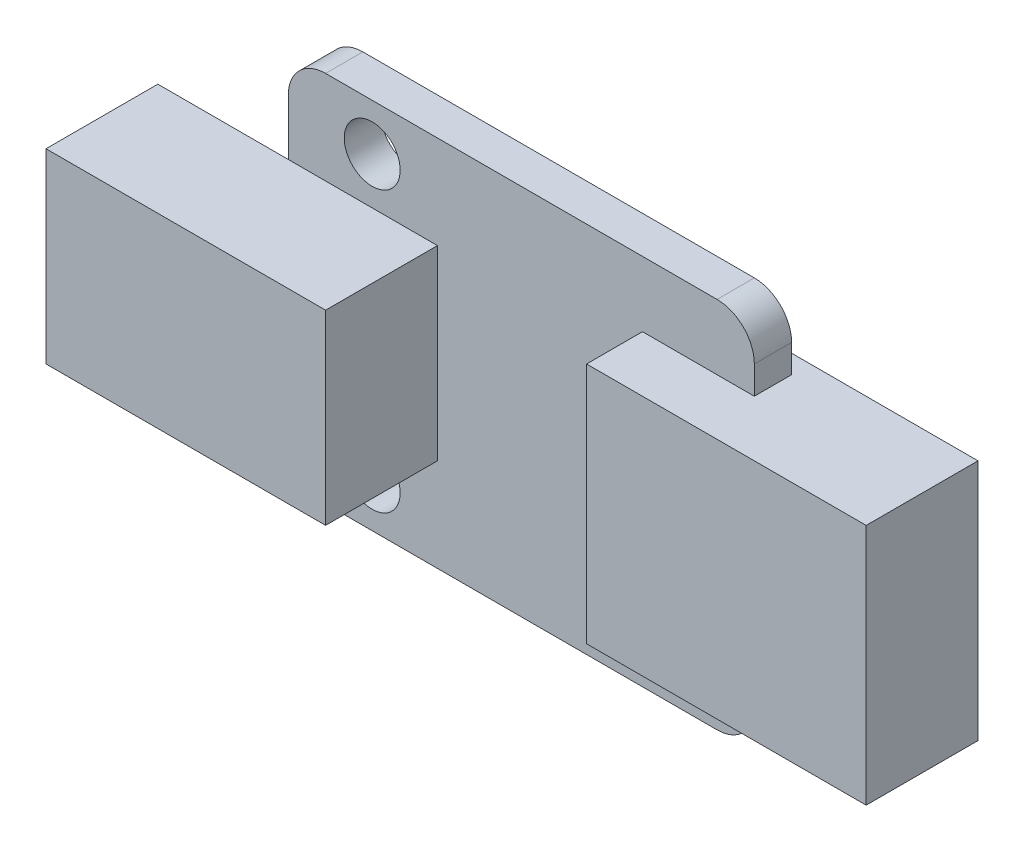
ISO-10303-21;
HEADER;
FILE_DESCRIPTION(('STEP AP214'),'2;1');
FILE_NAME('part.step','',(''),(''),'','','');
FILE_SCHEMA(('AUTOMOTIVE_DESIGN { 1 0 10303 214 1 1 1 1 }'));
ENDSEC;
DATA;
#1=APPLICATION_CONTEXT('core data for automotive mechanical design processes');
#2=APPLICATION_PROTOCOL_DEFINITION('international standard','automotive_design',2000,#1);
#3=PRODUCT_CONTEXT('',#1,'mechanical');
#4=PRODUCT('Part','Part','',(#3));
#5=PRODUCT_RELATED_PRODUCT_CATEGORY('part','',(#4));
#6=PRODUCT_DEFINITION_FORMATION('','',#4);
#7=PRODUCT_DEFINITION_CONTEXT('part definition',#1,'design');
#8=PRODUCT_DEFINITION('design','',#6,#7);
#9=PRODUCT_DEFINITION_SHAPE('','',#8);
#10=(LENGTH_UNIT() NAMED_UNIT(*) SI_UNIT(.MILLI.,.METRE.));
#11=(NAMED_UNIT(*) PLANE_ANGLE_UNIT() SI_UNIT($,.RADIAN.));
#12=(NAMED_UNIT(*) SI_UNIT($,.STERADIAN.) SOLID_ANGLE_UNIT());
#13=UNCERTAINTY_MEASURE_WITH_UNIT(LENGTH_MEASURE(1.E-05),#10,'distance_accuracy_value','');
#14=(GEOMETRIC_REPRESENTATION_CONTEXT(3) GLOBAL_UNCERTAINTY_ASSIGNED_CONTEXT((#13)) GLOBAL_UNIT_ASSIGNED_CONTEXT((#10,
#11,#12)) REPRESENTATION_CONTEXT('',''));
#15=CARTESIAN_POINT('',(0.,0.,0.));
#16=DIRECTION('',(0.,0.,1.));
#17=DIRECTION('',(1.,0.,0.));
#18=AXIS2_PLACEMENT_3D('',#15,#16,#17);
#19=CARTESIAN_POINT('',(0.,0.,2.));
#20=DIRECTION('',(0.,0.,1.));
#21=DIRECTION('',(1.,0.,0.));
#22=AXIS2_PLACEMENT_3D('',#19,#20,#21);
#23=PLANE('',#22);
#24=CARTESIAN_POINT('',(-8.,7.5,2.));
#25=DIRECTION('',(0.,0.,1.));
#26=DIRECTION('',(1.,0.,0.));
#27=AXIS2_PLACEMENT_3D('',#24,#25,#26);
#28=CIRCLE('',#27,1.5);
#29=CARTESIAN_POINT('',(-6.5,7.5,2.));
#30=VERTEX_POINT('',#29);
#31=EDGE_CURVE('E266',#30,#30,#28,.T.);
#32=ORIENTED_EDGE('',*,*,#31,.F.);
#33=EDGE_LOOP('',(#32));
#34=FACE_BOUND('',#33,.T.);
#35=CARTESIAN_POINT('',(-8.,-7.5,2.));
#36=DIRECTION('',(0.,0.,1.));
#37=DIRECTION('',(1.,0.,0.));
#38=AXIS2_PLACEMENT_3D('',#35,#36,#37);
#39=CIRCLE('',#38,1.5);
#40=CARTESIAN_POINT('',(-6.5,-7.5,2.));
#41=VERTEX_POINT('',#40);
#42=EDGE_CURVE('E260',#41,#41,#39,.T.);
#43=ORIENTED_EDGE('',*,*,#42,.F.);
#44=EDGE_LOOP('',(#43));
#45=FACE_BOUND('',#44,.T.);
#46=DIRECTION('',(-1.,0.,0.));
#47=VECTOR('',#46,1.);
#48=CARTESIAN_POINT('',(-12.5,10.,2.));
#49=LINE('',#48,#47);
#50=CARTESIAN_POINT('',(10.5,10.,2.));
#51=VERTEX_POINT('',#50);
#52=CARTESIAN_POINT('',(-10.5,10.,2.));
#53=VERTEX_POINT('',#52);
#54=EDGE_CURVE('E274',#51,#53,#49,.T.);
#55=ORIENTED_EDGE('',*,*,#54,.T.);
#56=CARTESIAN_POINT('',(-10.5,8.,2.));
#57=DIRECTION('',(0.,0.,1.));
#58=DIRECTION('',(1.,0.,0.));
#59=AXIS2_PLACEMENT_3D('',#56,#57,#58);
#60=CIRCLE('',#59,2.);
#61=CARTESIAN_POINT('',(-12.5,8.,2.));
#62=VERTEX_POINT('',#61);
#63=EDGE_CURVE('E327',#53,#62,#60,.T.);
#64=ORIENTED_EDGE('',*,*,#63,.T.);
#65=DIRECTION('',(0.,-1.,0.));
#66=VECTOR('',#65,1.);
#67=CARTESIAN_POINT('',(-12.5,10.,2.));
#68=LINE('',#67,#66);
#69=CARTESIAN_POINT('',(-12.5,5.,2.));
#70=VERTEX_POINT('',#69);
#71=EDGE_CURVE('E279',#62,#70,#68,.T.);
#72=ORIENTED_EDGE('',*,*,#71,.T.);
#73=DIRECTION('',(-1.,0.,0.));
#74=VECTOR('',#73,1.);
#75=CARTESIAN_POINT('',(-4.5,5.,2.));
#76=LINE('',#75,#74);
#77=CARTESIAN_POINT('',(-4.5,5.,2.));
#78=VERTEX_POINT('',#77);
#79=EDGE_CURVE('E203',#78,#70,#76,.T.);
#80=ORIENTED_EDGE('',*,*,#79,.F.);
#81=DIRECTION('',(0.,1.,0.));
#82=VECTOR('',#81,1.);
#83=CARTESIAN_POINT('',(-4.5,5.,2.));
#84=LINE('',#83,#82);
#85=CARTESIAN_POINT('',(-4.5,-5.,2.));
#86=VERTEX_POINT('',#85);
#87=EDGE_CURVE('E443',#86,#78,#84,.T.);
#88=ORIENTED_EDGE('',*,*,#87,.F.);
#89=DIRECTION('',(1.,0.,0.));
#90=VECTOR('',#89,1.);
#91=CARTESIAN_POINT('',(-4.5,-5.,2.));
#92=LINE('',#91,#90);
#93=CARTESIAN_POINT('',(-12.5,-5.,2.));
#94=VERTEX_POINT('',#93);
#95=EDGE_CURVE('E435',#94,#86,#92,.T.);
#96=ORIENTED_EDGE('',*,*,#95,.F.);
#97=CARTESIAN_POINT('',(-12.5,-8.,2.));
#98=VERTEX_POINT('',#97);
#99=EDGE_CURVE('E278',#94,#98,#68,.T.);
#100=ORIENTED_EDGE('',*,*,#99,.T.);
#101=CARTESIAN_POINT('',(-10.5,-8.,2.));
#102=DIRECTION('',(0.,0.,1.));
#103=DIRECTION('',(1.,0.,0.));
#104=AXIS2_PLACEMENT_3D('',#101,#102,#103);
#105=CIRCLE('',#104,2.);
#106=CARTESIAN_POINT('',(-10.5,-10.,2.));
#107=VERTEX_POINT('',#106);
#108=EDGE_CURVE('E323',#98,#107,#105,.T.);
#109=ORIENTED_EDGE('',*,*,#108,.T.);
#110=DIRECTION('',(1.,0.,0.));
#111=VECTOR('',#110,1.);
#112=CARTESIAN_POINT('',(-12.5,-10.,2.));
#113=LINE('',#112,#111);
#114=CARTESIAN_POINT('',(10.5,-10.,2.));
#115=VERTEX_POINT('',#114);
#116=EDGE_CURVE('E281',#107,#115,#113,.T.);
#117=ORIENTED_EDGE('',*,*,#116,.T.);
#118=CARTESIAN_POINT('',(10.5,-8.,2.));
#119=DIRECTION('',(0.,0.,1.));
#120=DIRECTION('',(1.,0.,0.));
#121=AXIS2_PLACEMENT_3D('',#118,#119,#120);
#122=CIRCLE('',#121,2.);
#123=CARTESIAN_POINT('',(12.5,-8.,2.));
#124=VERTEX_POINT('',#123);
#125=EDGE_CURVE('E58',#115,#124,#122,.T.);
#126=ORIENTED_EDGE('',*,*,#125,.T.);
#127=DIRECTION('',(0.,1.,0.));
#128=VECTOR('',#127,1.);
#129=CARTESIAN_POINT('',(12.5,10.,2.));
#130=LINE('',#129,#128);
#131=CARTESIAN_POINT('',(12.5,-6.5,2.));
#132=VERTEX_POINT('',#131);
#133=EDGE_CURVE('E272',#124,#132,#130,.T.);
#134=ORIENTED_EDGE('',*,*,#133,.T.);
#135=DIRECTION('',(-1.,0.,0.));
#136=VECTOR('',#135,1.);
#137=CARTESIAN_POINT('',(0.,-6.5,2.));
#138=LINE('',#137,#136);
#139=CARTESIAN_POINT('',(6.5,-6.5,2.));
#140=VERTEX_POINT('',#139);
#141=EDGE_CURVE('E250',#132,#140,#138,.T.);
#142=ORIENTED_EDGE('',*,*,#141,.T.);
#143=DIRECTION('',(0.,1.,0.));
#144=VECTOR('',#143,1.);
#145=CARTESIAN_POINT('',(6.5,0.,2.));
#146=LINE('',#145,#144);
#147=CARTESIAN_POINT('',(6.5,6.5,2.));
#148=VERTEX_POINT('',#147);
#149=EDGE_CURVE('E257',#140,#148,#146,.T.);
#150=ORIENTED_EDGE('',*,*,#149,.T.);
#151=DIRECTION('',(1.,0.,0.));
#152=VECTOR('',#151,1.);
#153=CARTESIAN_POINT('',(0.,6.5,2.));
#154=LINE('',#153,#152);
#155=CARTESIAN_POINT('',(12.5,6.5,2.));
#156=VERTEX_POINT('',#155);
#157=EDGE_CURVE('E255',#148,#156,#154,.T.);
#158=ORIENTED_EDGE('',*,*,#157,.T.);
#159=CARTESIAN_POINT('',(12.5,8.,2.));
#160=VERTEX_POINT('',#159);
#161=EDGE_CURVE('E275',#156,#160,#130,.T.);
#162=ORIENTED_EDGE('',*,*,#161,.T.);
#163=CARTESIAN_POINT('',(10.5,8.,2.));
#164=DIRECTION('',(0.,0.,1.));
#165=DIRECTION('',(1.,0.,0.));
#166=AXIS2_PLACEMENT_3D('',#163,#164,#165);
#167=CIRCLE('',#166,2.);
#168=EDGE_CURVE('E325',#160,#51,#167,.T.);
#169=ORIENTED_EDGE('',*,*,#168,.T.);
#170=EDGE_LOOP('',(#55,#64,#72,#80,#88,#96,#100,#109,#117,#126,#134,#142,#150,#158,#162,#169));
#171=FACE_BOUND('',#170,.T.);
#172=ADVANCED_FACE('F35',(#34,#45,#171),#23,.T.);
#173=CARTESIAN_POINT('',(0.,0.,0.));
#174=DIRECTION('',(0.,0.,1.));
#175=DIRECTION('',(1.,0.,0.));
#176=AXIS2_PLACEMENT_3D('',#173,#174,#175);
#177=PLANE('',#176);
#178=CARTESIAN_POINT('',(-8.,-7.5,0.));
#179=DIRECTION('',(0.,0.,1.));
#180=DIRECTION('',(1.,0.,0.));
#181=AXIS2_PLACEMENT_3D('',#178,#179,#180);
#182=CIRCLE('',#181,1.5);
#183=CARTESIAN_POINT('',(-6.5,-7.5,0.));
#184=VERTEX_POINT('',#183);
#185=EDGE_CURVE('E259',#184,#184,#182,.T.);
#186=ORIENTED_EDGE('',*,*,#185,.T.);
#187=EDGE_LOOP('',(#186));
#188=FACE_BOUND('',#187,.T.);
#189=CARTESIAN_POINT('',(-8.,7.5,0.));
#190=DIRECTION('',(0.,0.,1.));
#191=DIRECTION('',(1.,0.,0.));
#192=AXIS2_PLACEMENT_3D('',#189,#190,#191);
#193=CIRCLE('',#192,1.5);
#194=CARTESIAN_POINT('',(-6.5,7.5,0.));
#195=VERTEX_POINT('',#194);
#196=EDGE_CURVE('E263',#195,#195,#193,.T.);
#197=ORIENTED_EDGE('',*,*,#196,.T.);
#198=EDGE_LOOP('',(#197));
#199=FACE_BOUND('',#198,.T.);
#200=DIRECTION('',(0.,-1.,0.));
#201=VECTOR('',#200,1.);
#202=CARTESIAN_POINT('',(-12.5,10.,0.));
#203=LINE('',#202,#201);
#204=CARTESIAN_POINT('',(-12.5,8.,0.));
#205=VERTEX_POINT('',#204);
#206=CARTESIAN_POINT('',(-12.5,-8.,0.));
#207=VERTEX_POINT('',#206);
#208=EDGE_CURVE('E290',#205,#207,#203,.T.);
#209=ORIENTED_EDGE('',*,*,#208,.F.);
#210=CARTESIAN_POINT('',(-10.5,8.,0.));
#211=DIRECTION('',(0.,0.,1.));
#212=DIRECTION('',(1.,0.,0.));
#213=AXIS2_PLACEMENT_3D('',#210,#211,#212);
#214=CIRCLE('',#213,2.);
#215=CARTESIAN_POINT('',(-10.5,10.,0.));
#216=VERTEX_POINT('',#215);
#217=EDGE_CURVE('E315',#205,#216,#214,.F.);
#218=ORIENTED_EDGE('',*,*,#217,.T.);
#219=DIRECTION('',(-1.,0.,0.));
#220=VECTOR('',#219,1.);
#221=CARTESIAN_POINT('',(-12.5,10.,0.));
#222=LINE('',#221,#220);
#223=CARTESIAN_POINT('',(10.5,10.,0.));
#224=VERTEX_POINT('',#223);
#225=EDGE_CURVE('E287',#224,#216,#222,.T.);
#226=ORIENTED_EDGE('',*,*,#225,.F.);
#227=CARTESIAN_POINT('',(10.5,8.,0.));
#228=DIRECTION('',(0.,0.,1.));
#229=DIRECTION('',(1.,0.,0.));
#230=AXIS2_PLACEMENT_3D('',#227,#228,#229);
#231=CIRCLE('',#230,2.);
#232=CARTESIAN_POINT('',(12.5,8.,0.));
#233=VERTEX_POINT('',#232);
#234=EDGE_CURVE('E313',#224,#233,#231,.F.);
#235=ORIENTED_EDGE('',*,*,#234,.T.);
#236=DIRECTION('',(0.,1.,0.));
#237=VECTOR('',#236,1.);
#238=CARTESIAN_POINT('',(12.5,10.,0.));
#239=LINE('',#238,#237);
#240=CARTESIAN_POINT('',(12.5,6.5,0.));
#241=VERTEX_POINT('',#240);
#242=EDGE_CURVE('E269',#241,#233,#239,.T.);
#243=ORIENTED_EDGE('',*,*,#242,.F.);
#244=DIRECTION('',(1.,0.,0.));
#245=VECTOR('',#244,1.);
#246=CARTESIAN_POINT('',(0.,6.5,0.));
#247=LINE('',#246,#245);
#248=CARTESIAN_POINT('',(6.5,6.5,0.));
#249=VERTEX_POINT('',#248);
#250=EDGE_CURVE('E252',#249,#241,#247,.T.);
#251=ORIENTED_EDGE('',*,*,#250,.F.);
#252=DIRECTION('',(0.,1.,0.));
#253=VECTOR('',#252,1.);
#254=CARTESIAN_POINT('',(6.5,0.,0.));
#255=LINE('',#254,#253);
#256=CARTESIAN_POINT('',(6.5,-6.5,0.));
#257=VERTEX_POINT('',#256);
#258=EDGE_CURVE('E301',#257,#249,#255,.T.);
#259=ORIENTED_EDGE('',*,*,#258,.F.);
#260=DIRECTION('',(-1.,0.,0.));
#261=VECTOR('',#260,1.);
#262=CARTESIAN_POINT('',(0.,-6.5,0.));
#263=LINE('',#262,#261);
#264=CARTESIAN_POINT('',(12.5,-6.5,0.));
#265=VERTEX_POINT('',#264);
#266=EDGE_CURVE('E247',#265,#257,#263,.T.);
#267=ORIENTED_EDGE('',*,*,#266,.F.);
#268=CARTESIAN_POINT('',(12.5,-8.,0.));
#269=VERTEX_POINT('',#268);
#270=EDGE_CURVE('E285',#269,#265,#239,.T.);
#271=ORIENTED_EDGE('',*,*,#270,.F.);
#272=CARTESIAN_POINT('',(10.5,-8.,0.));
#273=DIRECTION('',(0.,0.,1.));
#274=DIRECTION('',(1.,0.,0.));
#275=AXIS2_PLACEMENT_3D('',#272,#273,#274);
#276=CIRCLE('',#275,2.);
#277=CARTESIAN_POINT('',(10.5,-10.,0.));
#278=VERTEX_POINT('',#277);
#279=EDGE_CURVE('E309',#269,#278,#276,.F.);
#280=ORIENTED_EDGE('',*,*,#279,.T.);
#281=DIRECTION('',(1.,0.,0.));
#282=VECTOR('',#281,1.);
#283=CARTESIAN_POINT('',(-12.5,-10.,0.));
#284=LINE('',#283,#282);
#285=CARTESIAN_POINT('',(-10.5,-10.,0.));
#286=VERTEX_POINT('',#285);
#287=EDGE_CURVE('E293',#286,#278,#284,.T.);
#288=ORIENTED_EDGE('',*,*,#287,.F.);
#289=CARTESIAN_POINT('',(-10.5,-8.,0.));
#290=DIRECTION('',(0.,0.,1.));
#291=DIRECTION('',(1.,0.,0.));
#292=AXIS2_PLACEMENT_3D('',#289,#290,#291);
#293=CIRCLE('',#292,2.);
#294=EDGE_CURVE('E311',#286,#207,#293,.F.);
#295=ORIENTED_EDGE('',*,*,#294,.T.);
#296=EDGE_LOOP('',(#209,#218,#226,#235,#243,#251,#259,#267,#271,#280,#288,#295));
#297=FACE_BOUND('',#296,.T.);
#298=ADVANCED_FACE('F342',(#188,#199,#297),#177,.F.);
#299=CARTESIAN_POINT('',(12.5,10.,2.));
#300=DIRECTION('',(-1.,0.,0.));
#301=DIRECTION('',(0.,0.,1.));
#302=AXIS2_PLACEMENT_3D('',#299,#300,#301);
#303=PLANE('',#302);
#304=ORIENTED_EDGE('',*,*,#242,.T.);
#305=DIRECTION('',(0.,0.,-1.));
#306=VECTOR('',#305,1.);
#307=CARTESIAN_POINT('',(12.5,8.,2.));
#308=LINE('',#307,#306);
#309=EDGE_CURVE('E50',#233,#160,#308,.F.);
#310=ORIENTED_EDGE('',*,*,#309,.T.);
#311=ORIENTED_EDGE('',*,*,#161,.F.);
#312=DIRECTION('',(0.,0.,1.));
#313=VECTOR('',#312,1.);
#314=CARTESIAN_POINT('',(12.5,6.5,2.));
#315=LINE('',#314,#313);
#316=EDGE_CURVE('E298',#241,#156,#315,.T.);
#317=ORIENTED_EDGE('',*,*,#316,.F.);
#318=EDGE_LOOP('',(#304,#310,#311,#317));
#319=FACE_BOUND('',#318,.T.);
#320=ADVANCED_FACE('F369',(#319),#303,.F.);
#321=ORIENTED_EDGE('',*,*,#133,.F.);
#322=DIRECTION('',(0.,0.,-1.));
#323=VECTOR('',#322,1.);
#324=CARTESIAN_POINT('',(12.5,-8.,2.));
#325=LINE('',#324,#323);
#326=EDGE_CURVE('E11',#124,#269,#325,.T.);
#327=ORIENTED_EDGE('',*,*,#326,.T.);
#328=ORIENTED_EDGE('',*,*,#270,.T.);
#329=DIRECTION('',(0.,0.,-1.));
#330=VECTOR('',#329,1.);
#331=CARTESIAN_POINT('',(12.5,-6.5,2.));
#332=LINE('',#331,#330);
#333=EDGE_CURVE('E284',#132,#265,#332,.T.);
#334=ORIENTED_EDGE('',*,*,#333,.F.);
#335=EDGE_LOOP('',(#321,#327,#328,#334));
#336=FACE_BOUND('',#335,.T.);
#337=ADVANCED_FACE('F348',(#336),#303,.F.);
#338=CARTESIAN_POINT('',(-12.5,10.,2.));
#339=DIRECTION('',(0.,-1.,0.));
#340=DIRECTION('',(0.,0.,-1.));
#341=AXIS2_PLACEMENT_3D('',#338,#339,#340);
#342=PLANE('',#341);
#343=ORIENTED_EDGE('',*,*,#225,.T.);
#344=DIRECTION('',(0.,0.,-1.));
#345=VECTOR('',#344,1.);
#346=CARTESIAN_POINT('',(-10.5,10.,2.));
#347=LINE('',#346,#345);
#348=EDGE_CURVE('E320',#216,#53,#347,.F.);
#349=ORIENTED_EDGE('',*,*,#348,.T.);
#350=ORIENTED_EDGE('',*,*,#54,.F.);
#351=DIRECTION('',(0.,0.,-1.));
#352=VECTOR('',#351,1.);
#353=CARTESIAN_POINT('',(10.5,10.,2.));
#354=LINE('',#353,#352);
#355=EDGE_CURVE('E317',#51,#224,#354,.T.);
#356=ORIENTED_EDGE('',*,*,#355,.T.);
#357=EDGE_LOOP('',(#343,#349,#350,#356));
#358=FACE_BOUND('',#357,.T.);
#359=ADVANCED_FACE('F413',(#358),#342,.F.);
#360=CARTESIAN_POINT('',(-12.5,10.,2.));
#361=DIRECTION('',(1.,0.,0.));
#362=DIRECTION('',(0.,1.,0.));
#363=AXIS2_PLACEMENT_3D('',#360,#361,#362);
#364=PLANE('',#363);
#365=ORIENTED_EDGE('',*,*,#71,.F.);
#366=DIRECTION('',(0.,0.,-1.));
#367=VECTOR('',#366,1.);
#368=CARTESIAN_POINT('',(-12.5,8.,2.));
#369=LINE('',#368,#367);
#370=EDGE_CURVE('E306',#62,#205,#369,.T.);
#371=ORIENTED_EDGE('',*,*,#370,.T.);
#372=ORIENTED_EDGE('',*,*,#208,.T.);
#373=DIRECTION('',(0.,0.,-1.));
#374=VECTOR('',#373,1.);
#375=CARTESIAN_POINT('',(-12.5,-8.,2.));
#376=LINE('',#375,#374);
#377=EDGE_CURVE('E304',#207,#98,#376,.F.);
#378=ORIENTED_EDGE('',*,*,#377,.T.);
#379=ORIENTED_EDGE('',*,*,#99,.F.);
#380=EDGE_CURVE('E282',#70,#94,#68,.T.);
#381=ORIENTED_EDGE('',*,*,#380,.F.);
#382=EDGE_LOOP('',(#365,#371,#372,#378,#379,#381));
#383=FACE_BOUND('',#382,.T.);
#384=ADVANCED_FACE('F410',(#383),#364,.F.);
#385=CARTESIAN_POINT('',(-12.5,-10.,2.));
#386=DIRECTION('',(0.,1.,0.));
#387=DIRECTION('',(0.,0.,1.));
#388=AXIS2_PLACEMENT_3D('',#385,#386,#387);
#389=PLANE('',#388);
#390=ORIENTED_EDGE('',*,*,#116,.F.);
#391=DIRECTION('',(0.,0.,-1.));
#392=VECTOR('',#391,1.);
#393=CARTESIAN_POINT('',(-10.5,-10.,2.));
#394=LINE('',#393,#392);
#395=EDGE_CURVE('E43',#107,#286,#394,.T.);
#396=ORIENTED_EDGE('',*,*,#395,.T.);
#397=ORIENTED_EDGE('',*,*,#287,.T.);
#398=DIRECTION('',(0.,0.,-1.));
#399=VECTOR('',#398,1.);
#400=CARTESIAN_POINT('',(10.5,-10.,2.));
#401=LINE('',#400,#399);
#402=EDGE_CURVE('E330',#278,#115,#401,.F.);
#403=ORIENTED_EDGE('',*,*,#402,.T.);
#404=EDGE_LOOP('',(#390,#396,#397,#403));
#405=FACE_BOUND('',#404,.T.);
#406=ADVANCED_FACE('F336',(#405),#389,.F.);
#407=CARTESIAN_POINT('',(-8.,7.5,2.));
#408=DIRECTION('',(0.,0.,-1.));
#409=DIRECTION('',(-1.,0.,0.));
#410=AXIS2_PLACEMENT_3D('',#407,#408,#409);
#411=CYLINDRICAL_SURFACE('',#410,1.5);
#412=ORIENTED_EDGE('',*,*,#31,.T.);
#413=EDGE_LOOP('',(#412));
#414=FACE_BOUND('',#413,.T.);
#415=ORIENTED_EDGE('',*,*,#196,.F.);
#416=EDGE_LOOP('',(#415));
#417=FACE_BOUND('',#416,.T.);
#418=ADVANCED_FACE('F405',(#414,#417),#411,.F.);
#419=CARTESIAN_POINT('',(-8.,-7.5,2.));
#420=DIRECTION('',(0.,0.,-1.));
#421=DIRECTION('',(-1.,0.,0.));
#422=AXIS2_PLACEMENT_3D('',#419,#420,#421);
#423=CYLINDRICAL_SURFACE('',#422,1.5);
#424=ORIENTED_EDGE('',*,*,#42,.T.);
#425=EDGE_LOOP('',(#424));
#426=FACE_BOUND('',#425,.T.);
#427=ORIENTED_EDGE('',*,*,#185,.F.);
#428=EDGE_LOOP('',(#427));
#429=FACE_BOUND('',#428,.T.);
#430=ADVANCED_FACE('F576',(#426,#429),#423,.F.);
#431=CARTESIAN_POINT('',(6.5,-6.5,5.));
#432=DIRECTION('',(1.,0.,0.));
#433=DIRECTION('',(0.,0.,-1.));
#434=AXIS2_PLACEMENT_3D('',#431,#432,#433);
#435=PLANE('',#434);
#436=DIRECTION('',(0.,0.,-1.));
#437=VECTOR('',#436,1.);
#438=CARTESIAN_POINT('',(6.5,-6.5,5.));
#439=LINE('',#438,#437);
#440=CARTESIAN_POINT('',(6.5,-6.5,-1.));
#441=VERTEX_POINT('',#440);
#442=EDGE_CURVE('E236',#257,#441,#439,.T.);
#443=ORIENTED_EDGE('',*,*,#442,.F.);
#444=ORIENTED_EDGE('',*,*,#258,.T.);
#445=DIRECTION('',(0.,0.,-1.));
#446=VECTOR('',#445,1.);
#447=CARTESIAN_POINT('',(6.5,6.5,5.));
#448=LINE('',#447,#446);
#449=CARTESIAN_POINT('',(6.5,6.5,-1.));
#450=VERTEX_POINT('',#449);
#451=EDGE_CURVE('E240',#249,#450,#448,.T.);
#452=ORIENTED_EDGE('',*,*,#451,.T.);
#453=DIRECTION('',(0.,-1.,0.));
#454=VECTOR('',#453,1.);
#455=CARTESIAN_POINT('',(6.5,-6.5,-1.));
#456=LINE('',#455,#454);
#457=EDGE_CURVE('E230',#450,#441,#456,.T.);
#458=ORIENTED_EDGE('',*,*,#457,.T.);
#459=EDGE_LOOP('',(#443,#444,#452,#458));
#460=FACE_BOUND('',#459,.T.);
#461=ADVANCED_FACE('F376',(#460),#435,.F.);
#462=CARTESIAN_POINT('',(21.5,-6.5,5.));
#463=DIRECTION('',(-1.,0.,0.));
#464=DIRECTION('',(0.,0.,1.));
#465=AXIS2_PLACEMENT_3D('',#462,#463,#464);
#466=PLANE('',#465);
#467=DIRECTION('',(0.,1.,0.));
#468=VECTOR('',#467,1.);
#469=CARTESIAN_POINT('',(21.5,-6.5,-1.));
#470=LINE('',#469,#468);
#471=CARTESIAN_POINT('',(21.5,-6.5,-1.));
#472=VERTEX_POINT('',#471);
#473=CARTESIAN_POINT('',(21.5,6.5,-1.));
#474=VERTEX_POINT('',#473);
#475=EDGE_CURVE('E208',#472,#474,#470,.T.);
#476=ORIENTED_EDGE('',*,*,#475,.T.);
#477=DIRECTION('',(0.,0.,-1.));
#478=VECTOR('',#477,1.);
#479=CARTESIAN_POINT('',(21.5,6.5,5.));
#480=LINE('',#479,#478);
#481=CARTESIAN_POINT('',(21.5,6.5,5.));
#482=VERTEX_POINT('',#481);
#483=EDGE_CURVE('E244',#482,#474,#480,.T.);
#484=ORIENTED_EDGE('',*,*,#483,.F.);
#485=DIRECTION('',(0.,1.,0.));
#486=VECTOR('',#485,1.);
#487=CARTESIAN_POINT('',(21.5,-6.5,5.));
#488=LINE('',#487,#486);
#489=CARTESIAN_POINT('',(21.5,-6.5,5.));
#490=VERTEX_POINT('',#489);
#491=EDGE_CURVE('E217',#490,#482,#488,.T.);
#492=ORIENTED_EDGE('',*,*,#491,.F.);
#493=DIRECTION('',(0.,0.,-1.));
#494=VECTOR('',#493,1.);
#495=CARTESIAN_POINT('',(21.5,-6.5,5.));
#496=LINE('',#495,#494);
#497=EDGE_CURVE('E226',#490,#472,#496,.T.);
#498=ORIENTED_EDGE('',*,*,#497,.T.);
#499=EDGE_LOOP('',(#476,#484,#492,#498));
#500=FACE_BOUND('',#499,.T.);
#501=ADVANCED_FACE('F381',(#500),#466,.F.);
#502=CARTESIAN_POINT('',(6.5,6.5,5.));
#503=DIRECTION('',(0.,-1.,0.));
#504=DIRECTION('',(0.,0.,-1.));
#505=AXIS2_PLACEMENT_3D('',#502,#503,#504);
#506=PLANE('',#505);
#507=ORIENTED_EDGE('',*,*,#157,.F.);
#508=CARTESIAN_POINT('',(6.5,6.5,5.));
#509=VERTEX_POINT('',#508);
#510=EDGE_CURVE('E241',#509,#148,#448,.T.);
#511=ORIENTED_EDGE('',*,*,#510,.F.);
#512=DIRECTION('',(-1.,0.,0.));
#513=VECTOR('',#512,1.);
#514=CARTESIAN_POINT('',(6.5,6.5,5.));
#515=LINE('',#514,#513);
#516=EDGE_CURVE('E220',#482,#509,#515,.T.);
#517=ORIENTED_EDGE('',*,*,#516,.F.);
#518=ORIENTED_EDGE('',*,*,#483,.T.);
#519=DIRECTION('',(-1.,0.,0.));
#520=VECTOR('',#519,1.);
#521=CARTESIAN_POINT('',(6.5,6.5,-1.));
#522=LINE('',#521,#520);
#523=EDGE_CURVE('E211',#474,#450,#522,.T.);
#524=ORIENTED_EDGE('',*,*,#523,.T.);
#525=ORIENTED_EDGE('',*,*,#451,.F.);
#526=ORIENTED_EDGE('',*,*,#250,.T.);
#527=ORIENTED_EDGE('',*,*,#316,.T.);
#528=EDGE_LOOP('',(#507,#511,#517,#518,#524,#525,#526,#527));
#529=FACE_BOUND('',#528,.T.);
#530=ADVANCED_FACE('F367',(#529),#506,.F.);
#531=ORIENTED_EDGE('',*,*,#149,.F.);
#532=CARTESIAN_POINT('',(6.5,-6.5,5.));
#533=VERTEX_POINT('',#532);
#534=EDGE_CURVE('E237',#533,#140,#439,.T.);
#535=ORIENTED_EDGE('',*,*,#534,.F.);
#536=DIRECTION('',(0.,-1.,0.));
#537=VECTOR('',#536,1.);
#538=CARTESIAN_POINT('',(6.5,-6.5,5.));
#539=LINE('',#538,#537);
#540=EDGE_CURVE('E223',#509,#533,#539,.T.);
#541=ORIENTED_EDGE('',*,*,#540,.F.);
#542=ORIENTED_EDGE('',*,*,#510,.T.);
#543=EDGE_LOOP('',(#531,#535,#541,#542));
#544=FACE_BOUND('',#543,.T.);
#545=ADVANCED_FACE('F356',(#544),#435,.F.);
#546=CARTESIAN_POINT('',(6.5,-6.5,5.));
#547=DIRECTION('',(0.,1.,0.));
#548=DIRECTION('',(0.,0.,1.));
#549=AXIS2_PLACEMENT_3D('',#546,#547,#548);
#550=PLANE('',#549);
#551=ORIENTED_EDGE('',*,*,#141,.F.);
#552=ORIENTED_EDGE('',*,*,#333,.T.);
#553=ORIENTED_EDGE('',*,*,#266,.T.);
#554=ORIENTED_EDGE('',*,*,#442,.T.);
#555=DIRECTION('',(1.,0.,0.));
#556=VECTOR('',#555,1.);
#557=CARTESIAN_POINT('',(6.5,-6.5,-1.));
#558=LINE('',#557,#556);
#559=EDGE_CURVE('E221',#441,#472,#558,.T.);
#560=ORIENTED_EDGE('',*,*,#559,.T.);
#561=ORIENTED_EDGE('',*,*,#497,.F.);
#562=DIRECTION('',(1.,0.,0.));
#563=VECTOR('',#562,1.);
#564=CARTESIAN_POINT('',(6.5,-6.5,5.));
#565=LINE('',#564,#563);
#566=EDGE_CURVE('E225',#533,#490,#565,.T.);
#567=ORIENTED_EDGE('',*,*,#566,.F.);
#568=ORIENTED_EDGE('',*,*,#534,.T.);
#569=EDGE_LOOP('',(#551,#552,#553,#554,#560,#561,#567,#568));
#570=FACE_BOUND('',#569,.T.);
#571=ADVANCED_FACE('F360',(#570),#550,.F.);
#572=CARTESIAN_POINT('',(0.,0.,5.));
#573=DIRECTION('',(0.,0.,-1.));
#574=DIRECTION('',(-1.,0.,0.));
#575=AXIS2_PLACEMENT_3D('',#572,#573,#574);
#576=PLANE('',#575);
#577=ORIENTED_EDGE('',*,*,#491,.T.);
#578=ORIENTED_EDGE('',*,*,#516,.T.);
#579=ORIENTED_EDGE('',*,*,#540,.T.);
#580=ORIENTED_EDGE('',*,*,#566,.T.);
#581=EDGE_LOOP('',(#577,#578,#579,#580));
#582=FACE_BOUND('',#581,.T.);
#583=ADVANCED_FACE('F364',(#582),#576,.F.);
#584=CARTESIAN_POINT('',(0.,0.,-1.));
#585=DIRECTION('',(0.,0.,-1.));
#586=DIRECTION('',(-1.,0.,0.));
#587=AXIS2_PLACEMENT_3D('',#584,#585,#586);
#588=PLANE('',#587);
#589=ORIENTED_EDGE('',*,*,#475,.F.);
#590=ORIENTED_EDGE('',*,*,#559,.F.);
#591=ORIENTED_EDGE('',*,*,#457,.F.);
#592=ORIENTED_EDGE('',*,*,#523,.F.);
#593=EDGE_LOOP('',(#589,#590,#591,#592));
#594=FACE_BOUND('',#593,.T.);
#595=ADVANCED_FACE('F382',(#594),#588,.T.);
#596=CARTESIAN_POINT('',(0.,0.,2.));
#597=DIRECTION('',(0.,0.,-1.));
#598=DIRECTION('',(-1.,0.,0.));
#599=AXIS2_PLACEMENT_3D('',#596,#597,#598);
#600=PLANE('',#599);
#601=ORIENTED_EDGE('',*,*,#380,.T.);
#602=CARTESIAN_POINT('',(-19.5,-5.,2.));
#603=VERTEX_POINT('',#602);
#604=EDGE_CURVE('E439',#603,#94,#92,.T.);
#605=ORIENTED_EDGE('',*,*,#604,.F.);
#606=DIRECTION('',(0.,-1.,0.));
#607=VECTOR('',#606,1.);
#608=CARTESIAN_POINT('',(-19.5,5.,2.));
#609=LINE('',#608,#607);
#610=CARTESIAN_POINT('',(-19.5,5.,2.));
#611=VERTEX_POINT('',#610);
#612=EDGE_CURVE('E207',#611,#603,#609,.T.);
#613=ORIENTED_EDGE('',*,*,#612,.F.);
#614=EDGE_CURVE('E440',#70,#611,#76,.T.);
#615=ORIENTED_EDGE('',*,*,#614,.F.);
#616=EDGE_LOOP('',(#601,#605,#613,#615));
#617=FACE_BOUND('',#616,.T.);
#618=ADVANCED_FACE('F384',(#617),#600,.T.);
#619=CARTESIAN_POINT('',(-19.5,5.,8.));
#620=DIRECTION('',(1.,0.,0.));
#621=DIRECTION('',(0.,0.,-1.));
#622=AXIS2_PLACEMENT_3D('',#619,#620,#621);
#623=PLANE('',#622);
#624=ORIENTED_EDGE('',*,*,#612,.T.);
#625=DIRECTION('',(0.,0.,-1.));
#626=VECTOR('',#625,1.);
#627=CARTESIAN_POINT('',(-19.5,-5.,8.));
#628=LINE('',#627,#626);
#629=CARTESIAN_POINT('',(-19.5,-5.,8.));
#630=VERTEX_POINT('',#629);
#631=EDGE_CURVE('E186',#630,#603,#628,.T.);
#632=ORIENTED_EDGE('',*,*,#631,.F.);
#633=DIRECTION('',(0.,-1.,0.));
#634=VECTOR('',#633,1.);
#635=CARTESIAN_POINT('',(-19.5,5.,8.));
#636=LINE('',#635,#634);
#637=CARTESIAN_POINT('',(-19.5,5.,8.));
#638=VERTEX_POINT('',#637);
#639=EDGE_CURVE('E194',#638,#630,#636,.T.);
#640=ORIENTED_EDGE('',*,*,#639,.F.);
#641=DIRECTION('',(0.,0.,-1.));
#642=VECTOR('',#641,1.);
#643=CARTESIAN_POINT('',(-19.5,5.,8.));
#644=LINE('',#643,#642);
#645=EDGE_CURVE('E451',#638,#611,#644,.T.);
#646=ORIENTED_EDGE('',*,*,#645,.T.);
#647=EDGE_LOOP('',(#624,#632,#640,#646));
#648=FACE_BOUND('',#647,.T.);
#649=ADVANCED_FACE('F205',(#648),#623,.F.);
#650=CARTESIAN_POINT('',(-4.5,-5.,8.));
#651=DIRECTION('',(0.,1.,0.));
#652=DIRECTION('',(-1.,0.,0.));
#653=AXIS2_PLACEMENT_3D('',#650,#651,#652);
#654=PLANE('',#653);
#655=ORIENTED_EDGE('',*,*,#604,.T.);
#656=ORIENTED_EDGE('',*,*,#95,.T.);
#657=DIRECTION('',(0.,0.,-1.));
#658=VECTOR('',#657,1.);
#659=CARTESIAN_POINT('',(-4.5,-5.,8.));
#660=LINE('',#659,#658);
#661=CARTESIAN_POINT('',(-4.5,-5.,8.));
#662=VERTEX_POINT('',#661);
#663=EDGE_CURVE('E190',#662,#86,#660,.T.);
#664=ORIENTED_EDGE('',*,*,#663,.F.);
#665=DIRECTION('',(1.,0.,0.));
#666=VECTOR('',#665,1.);
#667=CARTESIAN_POINT('',(-4.5,-5.,8.));
#668=LINE('',#667,#666);
#669=EDGE_CURVE('E181',#630,#662,#668,.T.);
#670=ORIENTED_EDGE('',*,*,#669,.F.);
#671=ORIENTED_EDGE('',*,*,#631,.T.);
#672=EDGE_LOOP('',(#655,#656,#664,#670,#671));
#673=FACE_BOUND('',#672,.T.);
#674=ADVANCED_FACE('F184',(#673),#654,.F.);
#675=CARTESIAN_POINT('',(-4.5,5.,8.));
#676=DIRECTION('',(-1.,0.,0.));
#677=DIRECTION('',(0.,-1.,0.));
#678=AXIS2_PLACEMENT_3D('',#675,#676,#677);
#679=PLANE('',#678);
#680=ORIENTED_EDGE('',*,*,#87,.T.);
#681=DIRECTION('',(0.,0.,-1.));
#682=VECTOR('',#681,1.);
#683=CARTESIAN_POINT('',(-4.5,5.,8.));
#684=LINE('',#683,#682);
#685=CARTESIAN_POINT('',(-4.5,5.,8.));
#686=VERTEX_POINT('',#685);
#687=EDGE_CURVE('E213',#686,#78,#684,.T.);
#688=ORIENTED_EDGE('',*,*,#687,.F.);
#689=DIRECTION('',(0.,1.,0.));
#690=VECTOR('',#689,1.);
#691=CARTESIAN_POINT('',(-4.5,5.,8.));
#692=LINE('',#691,#690);
#693=EDGE_CURVE('E193',#662,#686,#692,.T.);
#694=ORIENTED_EDGE('',*,*,#693,.F.);
#695=ORIENTED_EDGE('',*,*,#663,.T.);
#696=EDGE_LOOP('',(#680,#688,#694,#695));
#697=FACE_BOUND('',#696,.T.);
#698=ADVANCED_FACE('F457',(#697),#679,.F.);
#699=CARTESIAN_POINT('',(-4.5,5.,8.));
#700=DIRECTION('',(0.,-1.,0.));
#701=DIRECTION('',(1.,0.,0.));
#702=AXIS2_PLACEMENT_3D('',#699,#700,#701);
#703=PLANE('',#702);
#704=ORIENTED_EDGE('',*,*,#79,.T.);
#705=ORIENTED_EDGE('',*,*,#614,.T.);
#706=ORIENTED_EDGE('',*,*,#645,.F.);
#707=DIRECTION('',(-1.,0.,0.));
#708=VECTOR('',#707,1.);
#709=CARTESIAN_POINT('',(-4.5,5.,8.));
#710=LINE('',#709,#708);
#711=EDGE_CURVE('E199',#686,#638,#710,.T.);
#712=ORIENTED_EDGE('',*,*,#711,.F.);
#713=ORIENTED_EDGE('',*,*,#687,.T.);
#714=EDGE_LOOP('',(#704,#705,#706,#712,#713));
#715=FACE_BOUND('',#714,.T.);
#716=ADVANCED_FACE('F455',(#715),#703,.F.);
#717=CARTESIAN_POINT('',(0.,0.,8.));
#718=DIRECTION('',(0.,0.,-1.));
#719=DIRECTION('',(-1.,0.,0.));
#720=AXIS2_PLACEMENT_3D('',#717,#718,#719);
#721=PLANE('',#720);
#722=ORIENTED_EDGE('',*,*,#639,.T.);
#723=ORIENTED_EDGE('',*,*,#669,.T.);
#724=ORIENTED_EDGE('',*,*,#693,.T.);
#725=ORIENTED_EDGE('',*,*,#711,.T.);
#726=EDGE_LOOP('',(#722,#723,#724,#725));
#727=FACE_BOUND('',#726,.T.);
#728=ADVANCED_FACE('F197',(#727),#721,.F.);
#729=CARTESIAN_POINT('',(-10.5,8.,2.));
#730=DIRECTION('',(0.,0.,-1.));
#731=DIRECTION('',(-1.,0.,0.));
#732=AXIS2_PLACEMENT_3D('',#729,#730,#731);
#733=CYLINDRICAL_SURFACE('',#732,2.);
#734=ORIENTED_EDGE('',*,*,#63,.F.);
#735=ORIENTED_EDGE('',*,*,#348,.F.);
#736=ORIENTED_EDGE('',*,*,#217,.F.);
#737=ORIENTED_EDGE('',*,*,#370,.F.);
#738=EDGE_LOOP('',(#734,#735,#736,#737));
#739=FACE_BOUND('',#738,.T.);
#740=ADVANCED_FACE('F420',(#739),#733,.T.);
#741=CARTESIAN_POINT('',(10.5,8.,2.));
#742=DIRECTION('',(0.,0.,-1.));
#743=DIRECTION('',(-1.,0.,0.));
#744=AXIS2_PLACEMENT_3D('',#741,#742,#743);
#745=CYLINDRICAL_SURFACE('',#744,2.);
#746=ORIENTED_EDGE('',*,*,#168,.F.);
#747=ORIENTED_EDGE('',*,*,#309,.F.);
#748=ORIENTED_EDGE('',*,*,#234,.F.);
#749=ORIENTED_EDGE('',*,*,#355,.F.);
#750=EDGE_LOOP('',(#746,#747,#748,#749));
#751=FACE_BOUND('',#750,.T.);
#752=ADVANCED_FACE('F423',(#751),#745,.T.);
#753=CARTESIAN_POINT('',(-10.5,-8.,2.));
#754=DIRECTION('',(0.,0.,-1.));
#755=DIRECTION('',(-1.,0.,0.));
#756=AXIS2_PLACEMENT_3D('',#753,#754,#755);
#757=CYLINDRICAL_SURFACE('',#756,2.);
#758=ORIENTED_EDGE('',*,*,#108,.F.);
#759=ORIENTED_EDGE('',*,*,#377,.F.);
#760=ORIENTED_EDGE('',*,*,#294,.F.);
#761=ORIENTED_EDGE('',*,*,#395,.F.);
#762=EDGE_LOOP('',(#758,#759,#760,#761));
#763=FACE_BOUND('',#762,.T.);
#764=ADVANCED_FACE('F426',(#763),#757,.T.);
#765=CARTESIAN_POINT('',(10.5,-8.,2.));
#766=DIRECTION('',(0.,0.,-1.));
#767=DIRECTION('',(-1.,0.,0.));
#768=AXIS2_PLACEMENT_3D('',#765,#766,#767);
#769=CYLINDRICAL_SURFACE('',#768,2.);
#770=ORIENTED_EDGE('',*,*,#125,.F.);
#771=ORIENTED_EDGE('',*,*,#402,.F.);
#772=ORIENTED_EDGE('',*,*,#279,.F.);
#773=ORIENTED_EDGE('',*,*,#326,.F.);
#774=EDGE_LOOP('',(#770,#771,#772,#773));
#775=FACE_BOUND('',#774,.T.);
#776=ADVANCED_FACE('F37',(#775),#769,.T.);
#777=CLOSED_SHELL('',(#172,#298,#320,#337,#359,#384,#406,#418,#430,#461,#501,#530,#545,#571,
#583,#595,#618,#649,#674,#698,#716,#728,#740,#752,#764,#776));
#778=MANIFOLD_SOLID_BREP('B2',#777);
#779=ADVANCED_BREP_SHAPE_REPRESENTATION('',(#18,#778),#14);
#780=SHAPE_DEFINITION_REPRESENTATION(#9,#779);
ENDSEC;
END-ISO-10303-21;
